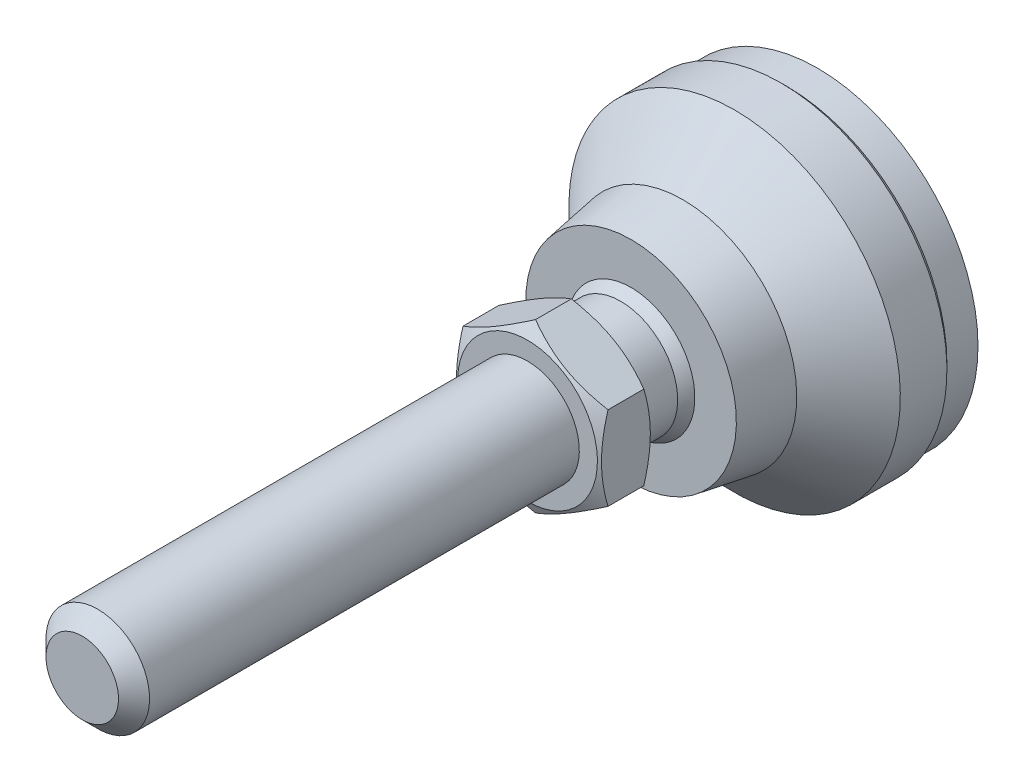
ISO-10303-21;
HEADER;
FILE_DESCRIPTION(('STEP AP214'),'2;1');
FILE_NAME('part.step','',(''),(''),'','','');
FILE_SCHEMA(('AUTOMOTIVE_DESIGN { 1 0 10303 214 1 1 1 1 }'));
ENDSEC;
DATA;
#1=APPLICATION_CONTEXT('core data for automotive mechanical design processes');
#2=APPLICATION_PROTOCOL_DEFINITION('international standard','automotive_design',2000,#1);
#3=PRODUCT_CONTEXT('',#1,'mechanical');
#4=PRODUCT('Part','Part','',(#3));
#5=PRODUCT_RELATED_PRODUCT_CATEGORY('part','',(#4));
#6=PRODUCT_DEFINITION_FORMATION('','',#4);
#7=PRODUCT_DEFINITION_CONTEXT('part definition',#1,'design');
#8=PRODUCT_DEFINITION('design','',#6,#7);
#9=PRODUCT_DEFINITION_SHAPE('','',#8);
#10=(LENGTH_UNIT() NAMED_UNIT(*) SI_UNIT(.MILLI.,.METRE.));
#11=(NAMED_UNIT(*) PLANE_ANGLE_UNIT() SI_UNIT($,.RADIAN.));
#12=(NAMED_UNIT(*) SI_UNIT($,.STERADIAN.) SOLID_ANGLE_UNIT());
#13=UNCERTAINTY_MEASURE_WITH_UNIT(LENGTH_MEASURE(1.E-05),#10,'distance_accuracy_value','');
#14=(GEOMETRIC_REPRESENTATION_CONTEXT(3) GLOBAL_UNCERTAINTY_ASSIGNED_CONTEXT((#13)) GLOBAL_UNIT_ASSIGNED_CONTEXT((#10,
#11,#12)) REPRESENTATION_CONTEXT('',''));
#15=CARTESIAN_POINT('',(0.,0.,0.));
#16=DIRECTION('',(0.,0.,1.));
#17=DIRECTION('',(1.,0.,0.));
#18=AXIS2_PLACEMENT_3D('',#15,#16,#17);
#19=CARTESIAN_POINT('',(0.,0.,3.));
#20=DIRECTION('',(0.,0.,-1.));
#21=DIRECTION('',(0.,1.,0.));
#22=AXIS2_PLACEMENT_3D('',#19,#20,#21);
#23=CYLINDRICAL_SURFACE('',#22,5.49999999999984);
#24=CARTESIAN_POINT('',(0.,0.,23.));
#25=DIRECTION('',(0.,0.,-1.));
#26=DIRECTION('',(0.,1.,0.));
#27=AXIS2_PLACEMENT_3D('',#24,#25,#26);
#28=CIRCLE('',#27,5.49999999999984);
#29=CARTESIAN_POINT('',(0.,5.49999999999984,23.));
#30=VERTEX_POINT('',#29);
#31=EDGE_CURVE('E112',#30,#30,#28,.T.);
#32=ORIENTED_EDGE('',*,*,#31,.T.);
#33=EDGE_LOOP('',(#32));
#34=FACE_BOUND('',#33,.T.);
#35=CARTESIAN_POINT('',(0.,0.,19.0000000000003));
#36=DIRECTION('',(0.,0.,1.));
#37=DIRECTION('',(0.,-1.,0.));
#38=AXIS2_PLACEMENT_3D('',#35,#36,#37);
#39=CIRCLE('',#38,5.49999999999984);
#40=CARTESIAN_POINT('',(-5.49999999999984,0.,19.0000000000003));
#41=VERTEX_POINT('',#40);
#42=EDGE_CURVE('E115',#41,#41,#39,.T.);
#43=ORIENTED_EDGE('',*,*,#42,.T.);
#44=EDGE_LOOP('',(#43));
#45=FACE_BOUND('',#44,.T.);
#46=ADVANCED_FACE('F14',(#34,#45),#23,.T.);
#47=CARTESIAN_POINT('',(0.,0.,14.6698729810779));
#48=DIRECTION('',(0.,0.,1.));
#49=DIRECTION('',(-1.,0.,0.));
#50=AXIS2_PLACEMENT_3D('',#47,#48,#49);
#51=SPHERICAL_SURFACE('',#50,7.);
#52=CARTESIAN_POINT('',(0.,0.,18.));
#53=DIRECTION('',(0.,0.,1.));
#54=DIRECTION('',(0.,-1.,0.));
#55=AXIS2_PLACEMENT_3D('',#52,#53,#54);
#56=CIRCLE('',#55,6.15713034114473);
#57=CARTESIAN_POINT('',(-6.15713034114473,0.,18.));
#58=VERTEX_POINT('',#57);
#59=EDGE_CURVE('E284',#58,#58,#56,.T.);
#60=CARTESIAN_POINT('',(-5.49999999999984,0.,19.0000000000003));
#61=CARTESIAN_POINT('',(-5.50771979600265,0.,18.9901945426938));
#62=CARTESIAN_POINT('',(-5.51541336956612,0.,18.9803684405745));
#63=CARTESIAN_POINT('',(-5.53074785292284,0.,18.9606752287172));
#64=CARTESIAN_POINT('',(-5.53838876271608,0.,18.9508081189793));
#65=CARTESIAN_POINT('',(-5.55361769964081,0.,18.9310331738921));
#66=CARTESIAN_POINT('',(-5.56120572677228,0.,18.9211253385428));
#67=CARTESIAN_POINT('',(-5.57632868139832,0.,18.9012692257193));
#68=CARTESIAN_POINT('',(-5.58386360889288,0.,18.8913209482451));
#69=CARTESIAN_POINT('',(-5.59888014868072,0.,18.871384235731));
#70=CARTESIAN_POINT('',(-5.60636176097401,0.,18.8613958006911));
#71=CARTESIAN_POINT('',(-5.62127145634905,0.,18.841379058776));
#72=CARTESIAN_POINT('',(-5.62869953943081,0.,18.8313507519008));
#73=CARTESIAN_POINT('',(-5.64350196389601,0.,18.81125455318));
#74=CARTESIAN_POINT('',(-5.65087630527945,0.,18.8011866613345));
#75=CARTESIAN_POINT('',(-5.66557103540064,0.,18.781011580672));
#76=CARTESIAN_POINT('',(-5.67289142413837,0.,18.770904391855));
#77=CARTESIAN_POINT('',(-5.68747803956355,0.,18.7506510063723));
#78=CARTESIAN_POINT('',(-5.69474426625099,0.,18.7405048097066));
#79=CARTESIAN_POINT('',(-5.70922234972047,0.,18.7201736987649));
#80=CARTESIAN_POINT('',(-5.7164342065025,0.,18.7099887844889));
#81=CARTESIAN_POINT('',(-5.7308033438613,0.,18.6895805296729));
#82=CARTESIAN_POINT('',(-5.73796062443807,0.,18.6793571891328));
#83=CARTESIAN_POINT('',(-5.75222040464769,0.,18.6588723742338));
#84=CARTESIAN_POINT('',(-5.75932290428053,0.,18.6486108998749));
#85=CARTESIAN_POINT('',(-5.77347291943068,0.,18.6280501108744));
#86=CARTESIAN_POINT('',(-5.78052043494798,0.,18.6177507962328));
#87=CARTESIAN_POINT('',(-5.79456028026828,0.,18.5971146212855));
#88=CARTESIAN_POINT('',(-5.80155261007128,0.,18.5867777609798));
#89=CARTESIAN_POINT('',(-5.81548188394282,0.,18.5660667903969));
#90=CARTESIAN_POINT('',(-5.82241882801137,0.,18.5556926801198));
#91=CARTESIAN_POINT('',(-5.83623713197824,0.,18.5349075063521));
#92=CARTESIAN_POINT('',(-5.84311849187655,0.,18.5244964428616));
#93=CARTESIAN_POINT('',(-5.85682543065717,0.,18.5036376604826));
#94=CARTESIAN_POINT('',(-5.86365100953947,0.,18.493189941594));
#95=CARTESIAN_POINT('',(-5.87724619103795,0.,18.4722581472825));
#96=CARTESIAN_POINT('',(-5.88401579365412,0.,18.4617740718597));
#97=CARTESIAN_POINT('',(-5.89749882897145,0.,18.4407698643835));
#98=CARTESIAN_POINT('',(-5.90421226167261,0.,18.4302497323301));
#99=CARTESIAN_POINT('',(-5.91758276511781,0.,18.4091737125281));
#100=CARTESIAN_POINT('',(-5.92423983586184,0.,18.3986178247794));
#101=CARTESIAN_POINT('',(-5.93749742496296,0.,18.3774705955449));
#102=CARTESIAN_POINT('',(-5.94409794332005,0.,18.366879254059));
#103=CARTESIAN_POINT('',(-5.95724223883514,0.,18.3456614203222));
#104=CARTESIAN_POINT('',(-5.96378601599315,0.,18.3350349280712));
#105=CARTESIAN_POINT('',(-5.9768166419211,0.,18.313747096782));
#106=CARTESIAN_POINT('',(-5.98330349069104,0.,18.3030857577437));
#107=CARTESIAN_POINT('',(-5.99622007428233,0.,18.2817285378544));
#108=CARTESIAN_POINT('',(-6.00264980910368,0.,18.2710326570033));
#109=CARTESIAN_POINT('',(-6.015451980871,0.,18.249606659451));
#110=CARTESIAN_POINT('',(-6.02182441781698,0.,18.2388765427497));
#111=CARTESIAN_POINT('',(-6.034511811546,0.,18.217382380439));
#112=CARTESIAN_POINT('',(-6.04082676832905,0.,18.2066183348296));
#113=CARTESIAN_POINT('',(-6.05339902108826,0.,18.1850566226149));
#114=CARTESIAN_POINT('',(-6.05965631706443,0.,18.1742589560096));
#115=CARTESIAN_POINT('',(-6.07211306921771,0.,18.1526303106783));
#116=CARTESIAN_POINT('',(-6.07831252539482,0.,18.1417993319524));
#117=CARTESIAN_POINT('',(-6.09065342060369,0.,18.1201043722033));
#118=CARTESIAN_POINT('',(-6.09679485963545,0.,18.1092403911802));
#119=CARTESIAN_POINT('',(-6.10901954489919,0.,18.0874797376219));
#120=CARTESIAN_POINT('',(-6.11510279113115,0.,18.0765830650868));
#121=CARTESIAN_POINT('',(-6.12721091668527,0.,18.054757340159));
#122=CARTESIAN_POINT('',(-6.13323579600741,0.,18.0438282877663));
#123=CARTESIAN_POINT('',(-6.14522701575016,0.,18.0219381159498));
#124=CARTESIAN_POINT('',(-6.15119335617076,0.,18.010976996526));
#125=CARTESIAN_POINT('',(-6.15713034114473,0.,18.));
#126=B_SPLINE_CURVE_WITH_KNOTS('',3,(#60,#61,#62,#63,#64,#65,#66,#67,#68,#69,#70,#71,#72,#73,
#74,#75,#76,#77,#78,#79,#80,#81,#82,#83,#84,#85,#86,#87,#88,#89,#90,#91,#92,#93,#94,#95,#96,#97,
#98,#99,#100,#101,#102,#103,#104,#105,#106,#107,#108,#109,#110,#111,#112,#113,#114,#115,#116,
#117,#118,#119,#120,#121,#122,#123,#124,#125),.UNSPECIFIED.,.F.,.F.,(4,2,2,2,2,2,2,2,2,2,2,2,2,
2,2,2,2,2,2,2,2,2,2,2,2,2,2,2,2,2,2,2,4),(0.,0.0374389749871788,0.0748779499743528,
0.112316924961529,0.149755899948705,0.187194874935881,0.224633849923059,0.262072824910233,
0.29951179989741,0.336950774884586,0.374389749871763,0.411828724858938,0.449267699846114,
0.486706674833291,0.524145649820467,0.561584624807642,0.599023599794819,0.636462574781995,
0.673901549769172,0.711340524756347,0.748779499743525,0.786218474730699,0.823657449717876,
0.86109642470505,0.898535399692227,0.935974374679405,0.973413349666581,1.01085232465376,
1.04829129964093,1.08573027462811,1.12316924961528,1.16060822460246,1.19804719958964),.UNSPECIFIED.);
#127=EDGE_CURVE('BSEAM243',#41,#58,#126,.T.);
#128=ORIENTED_EDGE('',*,*,#42,.F.);
#129=ORIENTED_EDGE('',*,*,#59,.T.);
#130=ORIENTED_EDGE('',*,*,#127,.T.);
#131=ORIENTED_EDGE('',*,*,#127,.F.);
#132=EDGE_LOOP('',(#128,#130,#129,#131));
#133=FACE_BOUND('',#132,.T.);
#134=ADVANCED_FACE('F243',(#133),#51,.T.);
#135=CARTESIAN_POINT('',(0.,0.,3.50000000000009));
#136=DIRECTION('',(0.,0.,1.));
#137=DIRECTION('',(0.,-1.,0.));
#138=AXIS2_PLACEMENT_3D('',#135,#136,#137);
#139=CONICAL_SURFACE('',#138,16.,0.785398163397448);
#140=CARTESIAN_POINT('',(0.,0.,3.00000000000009));
#141=DIRECTION('',(0.,0.,-1.));
#142=DIRECTION('',(0.,1.,0.));
#143=AXIS2_PLACEMENT_3D('',#140,#141,#142);
#144=CIRCLE('',#143,15.5);
#145=CARTESIAN_POINT('',(0.,15.5,3.00000000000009));
#146=VERTEX_POINT('',#145);
#147=EDGE_CURVE('E85',#146,#146,#144,.T.);
#148=ORIENTED_EDGE('',*,*,#147,.F.);
#149=EDGE_LOOP('',(#148));
#150=FACE_BOUND('',#149,.T.);
#151=CARTESIAN_POINT('',(0.,0.,3.50000000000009));
#152=DIRECTION('',(0.,0.,-1.));
#153=DIRECTION('',(0.,1.,0.));
#154=AXIS2_PLACEMENT_3D('',#151,#152,#153);
#155=CIRCLE('',#154,16.);
#156=CARTESIAN_POINT('',(0.,16.,3.50000000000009));
#157=VERTEX_POINT('',#156);
#158=EDGE_CURVE('E88',#157,#157,#155,.T.);
#159=ORIENTED_EDGE('',*,*,#158,.T.);
#160=EDGE_LOOP('',(#159));
#161=FACE_BOUND('',#160,.T.);
#162=ADVANCED_FACE('F246',(#150,#161),#139,.T.);
#163=CARTESIAN_POINT('',(0.,0.,3.));
#164=DIRECTION('',(0.,0.,-1.));
#165=DIRECTION('',(0.,1.,0.));
#166=AXIS2_PLACEMENT_3D('',#163,#164,#165);
#167=CYLINDRICAL_SURFACE('',#166,16.);
#168=ORIENTED_EDGE('',*,*,#158,.F.);
#169=EDGE_LOOP('',(#168));
#170=FACE_BOUND('',#169,.T.);
#171=CARTESIAN_POINT('',(0.,0.,8.00000000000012));
#172=DIRECTION('',(0.,0.,-1.));
#173=DIRECTION('',(0.,1.,0.));
#174=AXIS2_PLACEMENT_3D('',#171,#172,#173);
#175=CIRCLE('',#174,16.);
#176=CARTESIAN_POINT('',(0.,16.,8.00000000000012));
#177=VERTEX_POINT('',#176);
#178=EDGE_CURVE('E105',#177,#177,#175,.T.);
#179=ORIENTED_EDGE('',*,*,#178,.T.);
#180=EDGE_LOOP('',(#179));
#181=FACE_BOUND('',#180,.T.);
#182=ADVANCED_FACE('F391',(#170,#181),#167,.T.);
#183=CARTESIAN_POINT('',(0.,0.,13.));
#184=DIRECTION('',(0.,0.,-1.));
#185=DIRECTION('',(0.,1.,0.));
#186=AXIS2_PLACEMENT_3D('',#183,#184,#185);
#187=CONICAL_SURFACE('',#186,11.,0.785398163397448);
#188=ORIENTED_EDGE('',*,*,#178,.F.);
#189=EDGE_LOOP('',(#188));
#190=FACE_BOUND('',#189,.T.);
#191=CARTESIAN_POINT('',(0.,0.,13.));
#192=DIRECTION('',(0.,0.,-1.));
#193=DIRECTION('',(0.,1.,0.));
#194=AXIS2_PLACEMENT_3D('',#191,#192,#193);
#195=CIRCLE('',#194,11.);
#196=CARTESIAN_POINT('',(0.,11.,13.));
#197=VERTEX_POINT('',#196);
#198=EDGE_CURVE('E108',#197,#197,#195,.T.);
#199=ORIENTED_EDGE('',*,*,#198,.T.);
#200=EDGE_LOOP('',(#199));
#201=FACE_BOUND('',#200,.T.);
#202=ADVANCED_FACE('F398',(#190,#201),#187,.T.);
#203=CARTESIAN_POINT('',(0.,0.,19.));
#204=DIRECTION('',(0.,0.,-1.));
#205=DIRECTION('',(0.,1.,0.));
#206=AXIS2_PLACEMENT_3D('',#203,#204,#205);
#207=CONICAL_SURFACE('',#206,10.,0.165148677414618);
#208=ORIENTED_EDGE('',*,*,#198,.F.);
#209=EDGE_LOOP('',(#208));
#210=FACE_BOUND('',#209,.T.);
#211=CARTESIAN_POINT('',(0.,0.,18.));
#212=DIRECTION('',(0.,0.,-1.));
#213=DIRECTION('',(0.,1.,0.));
#214=AXIS2_PLACEMENT_3D('',#211,#212,#213);
#215=CIRCLE('',#214,10.1666666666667);
#216=CARTESIAN_POINT('',(0.,10.1666666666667,18.));
#217=VERTEX_POINT('',#216);
#218=EDGE_CURVE('E93',#217,#217,#215,.T.);
#219=ORIENTED_EDGE('',*,*,#218,.T.);
#220=EDGE_LOOP('',(#219));
#221=FACE_BOUND('',#220,.T.);
#222=ADVANCED_FACE('F241',(#210,#221),#207,.T.);
#223=CARTESIAN_POINT('',(-10.1666666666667,0.,18.));
#224=DIRECTION('',(0.,0.,1.));
#225=DIRECTION('',(0.,-1.,0.));
#226=AXIS2_PLACEMENT_3D('',#223,#224,#225);
#227=PLANE('',#226);
#228=ORIENTED_EDGE('',*,*,#218,.F.);
#229=EDGE_LOOP('',(#228));
#230=FACE_BOUND('',#229,.T.);
#231=ORIENTED_EDGE('',*,*,#59,.F.);
#232=EDGE_LOOP('',(#231));
#233=FACE_BOUND('',#232,.T.);
#234=ADVANCED_FACE('F236',(#230,#233),#227,.T.);
#235=CARTESIAN_POINT('',(0.,-8.08290376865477,23.));
#236=DIRECTION('',(0.,0.,-1.));
#237=DIRECTION('',(0.,1.,0.));
#238=AXIS2_PLACEMENT_3D('',#235,#236,#237);
#239=PLANE('',#238);
#240=CARTESIAN_POINT('',(0.,0.,23.));
#241=DIRECTION('',(0.,0.,1.));
#242=DIRECTION('',(0.,-1.,0.));
#243=AXIS2_PLACEMENT_3D('',#240,#241,#242);
#244=CIRCLE('',#243,6.75);
#245=CARTESIAN_POINT('',(0.,-6.75,23.));
#246=VERTEX_POINT('',#245);
#247=EDGE_CURVE('E80',#246,#246,#244,.T.);
#248=ORIENTED_EDGE('',*,*,#247,.F.);
#249=EDGE_LOOP('',(#248));
#250=FACE_BOUND('',#249,.T.);
#251=ORIENTED_EDGE('',*,*,#31,.F.);
#252=EDGE_LOOP('',(#251));
#253=FACE_BOUND('',#252,.T.);
#254=ADVANCED_FACE('F240',(#250,#253),#239,.T.);
#255=CARTESIAN_POINT('',(0.,0.,0.));
#256=DIRECTION('',(0.,0.,1.));
#257=DIRECTION('',(0.,-1.,0.));
#258=AXIS2_PLACEMENT_3D('',#255,#256,#257);
#259=CYLINDRICAL_SURFACE('',#258,15.5);
#260=CARTESIAN_POINT('',(0.,0.,0.));
#261=DIRECTION('',(0.,0.,-1.));
#262=DIRECTION('',(0.,1.,0.));
#263=AXIS2_PLACEMENT_3D('',#260,#261,#262);
#264=CIRCLE('',#263,15.5);
#265=CARTESIAN_POINT('',(0.,15.5,0.));
#266=VERTEX_POINT('',#265);
#267=EDGE_CURVE('E292',#266,#266,#264,.T.);
#268=ORIENTED_EDGE('',*,*,#267,.F.);
#269=EDGE_LOOP('',(#268));
#270=FACE_BOUND('',#269,.T.);
#271=ORIENTED_EDGE('',*,*,#147,.T.);
#272=EDGE_LOOP('',(#271));
#273=FACE_BOUND('',#272,.T.);
#274=ADVANCED_FACE('F250',(#270,#273),#259,.T.);
#275=CARTESIAN_POINT('',(0.,0.,0.));
#276=DIRECTION('',(0.,0.,-1.));
#277=DIRECTION('',(0.,1.,0.));
#278=AXIS2_PLACEMENT_3D('',#275,#276,#277);
#279=PLANE('',#278);
#280=ORIENTED_EDGE('',*,*,#267,.T.);
#281=EDGE_LOOP('',(#280));
#282=FACE_BOUND('',#281,.T.);
#283=ADVANCED_FACE('F133',(#282),#279,.T.);
#284=CARTESIAN_POINT('',(0.,0.,23.));
#285=DIRECTION('',(0.,0.,1.));
#286=DIRECTION('',(0.,-1.,0.));
#287=AXIS2_PLACEMENT_3D('',#284,#285,#286);
#288=CONICAL_SURFACE('',#287,6.75,1.0471975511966);
#289=CARTESIAN_POINT('',(7.0002,-4.04133641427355,23.7696190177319));
#290=CARTESIAN_POINT('',(6.84633209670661,-4.13017208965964,23.7183374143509));
#291=CARTESIAN_POINT('',(6.69189049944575,-4.21933898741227,23.669383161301));
#292=CARTESIAN_POINT('',(6.38175307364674,-4.3983969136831,23.5767703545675));
#293=CARTESIAN_POINT('',(6.22605673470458,-4.4882882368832,23.5331140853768));
#294=CARTESIAN_POINT('',(5.75647483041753,-4.7594014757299,23.4109491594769));
#295=CARTESIAN_POINT('',(5.4407356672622,-4.94169356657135,23.3414631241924));
#296=CARTESIAN_POINT('',(4.96823775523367,-5.21449036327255,23.2599825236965));
#297=CARTESIAN_POINT('',(4.81289077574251,-5.30417998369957,23.2367710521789));
#298=CARTESIAN_POINT('',(4.50149488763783,-5.48396448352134,23.1978487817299));
#299=CARTESIAN_POINT('',(4.34544604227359,-5.57405932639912,23.1821373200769));
#300=CARTESIAN_POINT('',(4.03307732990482,-5.75440548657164,23.1586154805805));
#301=CARTESIAN_POINT('',(3.87675797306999,-5.84465650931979,23.1507961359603));
#302=CARTESIAN_POINT('',(3.56398349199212,-6.02523694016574,23.1432178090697));
#303=CARTESIAN_POINT('',(3.40752837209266,-6.11556634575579,23.1434585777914));
#304=CARTESIAN_POINT('',(2.97889312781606,-6.36303901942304,23.155197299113));
#305=CARTESIAN_POINT('',(2.7068533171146,-6.52010127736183,23.1749033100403));
#306=CARTESIAN_POINT('',(2.1645805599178,-6.8331825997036,23.2373910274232));
#307=CARTESIAN_POINT('',(1.89434952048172,-6.98920056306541,23.2801940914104));
#308=CARTESIAN_POINT('',(1.35098545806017,-7.30291195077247,23.3871892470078));
#309=CARTESIAN_POINT('',(1.07792099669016,-7.46056579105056,23.4518346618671));
#310=CARTESIAN_POINT('',(0.535864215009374,-7.77352241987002,23.5985536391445));
#311=CARTESIAN_POINT('',(0.266864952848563,-7.92882921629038,23.680592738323));
#312=CARTESIAN_POINT('',(-0.000199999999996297,-8.08301923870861,23.7696190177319));
#313=B_SPLINE_CURVE_WITH_KNOTS('',3,(#289,#290,#291,#292,#293,#294,#295,#296,#297,#298,#299,
#300,#301,#302,#303,#304,#305,#306,#307,#308,#309,#310,#311,#312),.UNSPECIFIED.,.F.,.F.,(4,2,2,
2,2,2,2,2,2,2,2,4),(0.,0.554727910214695,1.10969417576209,2.2219327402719,2.76443041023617,
3.30688013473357,3.8487128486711,4.39052882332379,5.33376515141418,6.27787517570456,
7.24292418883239,8.20607866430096),.UNSPECIFIED.);
#314=CARTESIAN_POINT('',(7.,-4.04145188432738,23.7695523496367));
#315=VERTEX_POINT('',#314);
#316=CARTESIAN_POINT('',(0.,-8.08290376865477,23.7695523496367));
#317=VERTEX_POINT('',#316);
#318=EDGE_CURVE('E33',#315,#317,#313,.T.);
#319=ORIENTED_EDGE('',*,*,#318,.T.);
#320=CARTESIAN_POINT('',(0.000200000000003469,-8.0830192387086,23.7696190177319));
#321=CARTESIAN_POINT('',(-0.15366790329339,-7.99418356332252,23.7183374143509));
#322=CARTESIAN_POINT('',(-0.308109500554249,-7.90501666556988,23.669383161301));
#323=CARTESIAN_POINT('',(-0.618246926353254,-7.72595873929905,23.5767703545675));
#324=CARTESIAN_POINT('',(-0.773943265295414,-7.63606741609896,23.5331140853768));
#325=CARTESIAN_POINT('',(-1.24352516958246,-7.36495417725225,23.4109491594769));
#326=CARTESIAN_POINT('',(-1.5592643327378,-7.18266208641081,23.3414631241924));
#327=CARTESIAN_POINT('',(-2.03176224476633,-6.90986528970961,23.2599825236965));
#328=CARTESIAN_POINT('',(-2.18710922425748,-6.82017566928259,23.2367710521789));
#329=CARTESIAN_POINT('',(-2.49850511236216,-6.64039116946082,23.1978487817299));
#330=CARTESIAN_POINT('',(-2.65455395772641,-6.55029632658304,23.1821373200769));
#331=CARTESIAN_POINT('',(-2.96692267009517,-6.36995016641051,23.1586154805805));
#332=CARTESIAN_POINT('',(-3.12324202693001,-6.27969914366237,23.1507961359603));
#333=CARTESIAN_POINT('',(-3.43601650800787,-6.09911871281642,23.1432178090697));
#334=CARTESIAN_POINT('',(-3.59247162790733,-6.00878930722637,23.1434585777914));
#335=CARTESIAN_POINT('',(-4.02110687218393,-5.76131663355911,23.155197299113));
#336=CARTESIAN_POINT('',(-4.29314668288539,-5.60425437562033,23.1749033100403));
#337=CARTESIAN_POINT('',(-4.83541944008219,-5.29117305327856,23.2373910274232));
#338=CARTESIAN_POINT('',(-5.10565047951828,-5.13515508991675,23.2801940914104));
#339=CARTESIAN_POINT('',(-5.64901454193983,-4.82144370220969,23.3871892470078));
#340=CARTESIAN_POINT('',(-5.92207900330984,-4.6637898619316,23.4518346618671));
#341=CARTESIAN_POINT('',(-6.46413578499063,-4.35083323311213,23.5985536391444));
#342=CARTESIAN_POINT('',(-6.73313504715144,-4.19552643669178,23.680592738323));
#343=CARTESIAN_POINT('',(-7.0002,-4.04133641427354,23.7696190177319));
#344=B_SPLINE_CURVE_WITH_KNOTS('',3,(#320,#321,#322,#323,#324,#325,#326,#327,#328,#329,#330,
#331,#332,#333,#334,#335,#336,#337,#338,#339,#340,#341,#342,#343),.UNSPECIFIED.,.F.,.F.,(4,2,2,
2,2,2,2,2,2,2,2,4),(0.,0.554727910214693,1.10969417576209,2.2219327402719,2.76443041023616,
3.30688013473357,3.84871284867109,4.39052882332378,5.33376515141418,6.27787517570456,
7.2429241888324,8.20607866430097),.UNSPECIFIED.);
#345=CARTESIAN_POINT('',(-7.,-4.04145188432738,23.7695523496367));
#346=VERTEX_POINT('',#345);
#347=EDGE_CURVE('E9',#317,#346,#344,.T.);
#348=ORIENTED_EDGE('',*,*,#347,.T.);
#349=CARTESIAN_POINT('',(-7.,10.8531187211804,26.5592070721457));
#350=CARTESIAN_POINT('',(-7.,10.5474047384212,26.4109193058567));
#351=CARTESIAN_POINT('',(-7.,10.2409886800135,26.2640541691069));
#352=CARTESIAN_POINT('',(-7.,9.62637902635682,25.9739693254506));
#353=CARTESIAN_POINT('',(-7.,9.31818515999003,25.8307501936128));
#354=CARTESIAN_POINT('',(-7.,8.69805731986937,25.5480364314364));
#355=CARTESIAN_POINT('',(-7.,8.3861121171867,25.4085663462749));
#356=CARTESIAN_POINT('',(-7.,7.75973970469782,25.1353373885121));
#357=CARTESIAN_POINT('',(-7.,7.44531261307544,25.0015782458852));
#358=CARTESIAN_POINT('',(-7.,6.80333875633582,24.7371027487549));
#359=CARTESIAN_POINT('',(-7.,6.47569459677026,24.6066214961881));
#360=CARTESIAN_POINT('',(-7.,5.81657285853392,24.3555408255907));
#361=CARTESIAN_POINT('',(-7.,5.48509485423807,24.2349425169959));
#362=CARTESIAN_POINT('',(-7.,4.81839534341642,24.0067959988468));
#363=CARTESIAN_POINT('',(-7.,4.48318298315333,23.8992213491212));
#364=CARTESIAN_POINT('',(-7.,3.80796186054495,23.7005744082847));
#365=CARTESIAN_POINT('',(-7.,3.4679546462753,23.6094969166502));
#366=CARTESIAN_POINT('',(-7.,2.78478034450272,23.4487070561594));
#367=CARTESIAN_POINT('',(-7.,2.441641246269,23.3788789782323));
#368=CARTESIAN_POINT('',(-7.,1.92381001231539,23.2930984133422));
#369=CARTESIAN_POINT('',(-7.,1.75066644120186,23.267663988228));
#370=CARTESIAN_POINT('',(-7.,1.40351960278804,23.2236145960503));
#371=CARTESIAN_POINT('',(-7.,1.22951642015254,23.2049989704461));
#372=CARTESIAN_POINT('',(-7.,0.88315555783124,23.1751913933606));
#373=CARTESIAN_POINT('',(-7.,0.710805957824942,23.1639059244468));
#374=CARTESIAN_POINT('',(-7.,0.365784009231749,23.1486331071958));
#375=CARTESIAN_POINT('',(-7.,0.193111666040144,23.1446456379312));
#376=CARTESIAN_POINT('',(-7.,-0.152247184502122,23.1440639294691));
#377=CARTESIAN_POINT('',(-7.,-0.324933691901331,23.1474697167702));
#378=CARTESIAN_POINT('',(-7.,-0.670009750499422,23.1615913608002));
#379=CARTESIAN_POINT('',(-7.,-0.842399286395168,23.1723075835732));
#380=CARTESIAN_POINT('',(-7.,-1.25678281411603,23.2066267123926));
#381=CARTESIAN_POINT('',(-7.,-1.49849523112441,23.2337025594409));
#382=CARTESIAN_POINT('',(-7.,-1.98011296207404,23.3007484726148));
#383=CARTESIAN_POINT('',(-7.,-2.22001802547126,23.3407202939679));
#384=CARTESIAN_POINT('',(-7.,-2.93675513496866,23.4778590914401));
#385=CARTESIAN_POINT('',(-7.,-3.41033934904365,23.5922241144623));
#386=CARTESIAN_POINT('',(-7.,-4.11847376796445,23.7903830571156));
#387=CARTESIAN_POINT('',(-7.,-4.356700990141,23.8617912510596));
#388=CARTESIAN_POINT('',(-7.,-4.83084131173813,24.0119846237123));
#389=CARTESIAN_POINT('',(-7.,-5.06675439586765,24.0907698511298));
#390=CARTESIAN_POINT('',(-7.,-5.53634144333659,24.2544564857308));
#391=CARTESIAN_POINT('',(-7.,-5.77001612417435,24.3393558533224));
#392=CARTESIAN_POINT('',(-7.,-6.23543203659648,24.5142757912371));
#393=CARTESIAN_POINT('',(-7.,-6.46717329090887,24.6042963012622));
#394=CARTESIAN_POINT('',(-7.,-7.01442504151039,24.8227292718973));
#395=CARTESIAN_POINT('',(-7.,-7.32918572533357,24.9530168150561));
#396=CARTESIAN_POINT('',(-7.,-7.95602894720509,25.2199010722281));
#397=CARTESIAN_POINT('',(-7.,-8.26811131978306,25.3564981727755));
#398=CARTESIAN_POINT('',(-7.,-8.89009136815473,25.6347326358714));
#399=CARTESIAN_POINT('',(-7.,-9.19998858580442,25.7763710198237));
#400=CARTESIAN_POINT('',(-7.,-9.81791263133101,26.0636778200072));
#401=CARTESIAN_POINT('',(-7.,-10.1259394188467,26.2093463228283));
#402=CARTESIAN_POINT('',(-7.,-10.7407530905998,26.5041110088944));
#403=CARTESIAN_POINT('',(-7.,-11.047538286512,26.6532107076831));
#404=CARTESIAN_POINT('',(-7.,-11.659786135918,26.9541036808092));
#405=CARTESIAN_POINT('',(-7.,-11.9652487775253,27.1058969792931));
#406=CARTESIAN_POINT('',(-7.,-12.879887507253,27.5645591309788));
#407=CARTESIAN_POINT('',(-7.,-13.4873973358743,27.8747503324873));
#408=CARTESIAN_POINT('',(-7.,-14.6482473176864,28.4750183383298));
#409=CARTESIAN_POINT('',(-7.,-15.2018478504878,28.7645938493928));
#410=CARTESIAN_POINT('',(-7.,-16.3069938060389,29.3476848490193));
#411=CARTESIAN_POINT('',(-7.,-16.8585391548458,29.6412004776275));
#412=CARTESIAN_POINT('',(-7.,-17.9586488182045,30.2304932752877));
#413=CARTESIAN_POINT('',(-7.,-18.5072171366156,30.5262629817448));
#414=CARTESIAN_POINT('',(-7.,-19.6030401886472,31.120154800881));
#415=CARTESIAN_POINT('',(-7.,-20.1502949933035,31.41827678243));
#416=CARTESIAN_POINT('',(-7.,-20.6970665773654,31.7172764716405));
#417=B_SPLINE_CURVE_WITH_KNOTS('',3,(#349,#350,#351,#352,#353,#354,#355,#356,#357,#358,#359,
#360,#361,#362,#363,#364,#365,#366,#367,#368,#369,#370,#371,#372,#373,#374,#375,#376,#377,#378,
#379,#380,#381,#382,#383,#384,#385,#386,#387,#388,#389,#390,#391,#392,#393,#394,#395,#396,#397,
#398,#399,#400,#401,#402,#403,#404,#405,#406,#407,#408,#409,#410,#411,#412,#413,#414,#415,#416),
.UNSPECIFIED.,.F.,.F.,(4,2,2,2,2,2,2,2,2,2,2,2,2,2,2,2,2,2,2,2,2,2,2,2,2,2,2,2,2,2,2,2,2,4),(0.,
1.01935180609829,2.0388634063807,3.063929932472,4.08894793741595,5.14683390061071,
6.20483845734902,7.26065773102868,8.31614358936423,9.36577471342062,9.89066676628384,
10.4155081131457,10.9335147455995,11.4515127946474,11.9695127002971,12.4875385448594,
13.2167988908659,13.9461585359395,15.4056869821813,16.1517230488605,16.8977640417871,
17.6435573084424,18.389341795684,19.4112284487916,20.4331777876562,21.4553353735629,
22.4775149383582,23.5007930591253,24.524080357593,26.5703786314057,28.444647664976,
30.3189834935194,32.1886464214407,34.0582058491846),.UNSPECIFIED.);
#418=CARTESIAN_POINT('',(-7.,4.04145188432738,23.7695523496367));
#419=VERTEX_POINT('',#418);
#420=EDGE_CURVE('E72',#346,#419,#417,.F.);
#421=ORIENTED_EDGE('',*,*,#420,.T.);
#422=CARTESIAN_POINT('',(-7.0002,4.04133641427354,23.7696190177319));
#423=CARTESIAN_POINT('',(-6.84633209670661,4.13017208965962,23.7183374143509));
#424=CARTESIAN_POINT('',(-6.69189049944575,4.21933898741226,23.669383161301));
#425=CARTESIAN_POINT('',(-6.38175307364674,4.39839691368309,23.5767703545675));
#426=CARTESIAN_POINT('',(-6.22605673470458,4.48828823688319,23.5331140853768));
#427=CARTESIAN_POINT('',(-5.75647483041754,4.75940147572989,23.4109491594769));
#428=CARTESIAN_POINT('',(-5.4407356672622,4.94169356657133,23.3414631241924));
#429=CARTESIAN_POINT('',(-4.96823775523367,5.21449036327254,23.2599825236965));
#430=CARTESIAN_POINT('',(-4.81289077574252,5.30417998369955,23.2367710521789));
#431=CARTESIAN_POINT('',(-4.50149488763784,5.48396448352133,23.1978487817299));
#432=CARTESIAN_POINT('',(-4.34544604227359,5.57405932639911,23.1821373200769));
#433=CARTESIAN_POINT('',(-4.03307732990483,5.75440548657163,23.1586154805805));
#434=CARTESIAN_POINT('',(-3.87675797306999,5.84465650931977,23.1507961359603));
#435=CARTESIAN_POINT('',(-3.56398349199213,6.02523694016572,23.1432178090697));
#436=CARTESIAN_POINT('',(-3.40752837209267,6.11556634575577,23.1434585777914));
#437=CARTESIAN_POINT('',(-2.97889312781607,6.36303901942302,23.155197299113));
#438=CARTESIAN_POINT('',(-2.7068533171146,6.52010127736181,23.1749033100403));
#439=CARTESIAN_POINT('',(-2.16458055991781,6.83318259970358,23.2373910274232));
#440=CARTESIAN_POINT('',(-1.89434952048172,6.9892005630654,23.2801940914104));
#441=CARTESIAN_POINT('',(-1.35098545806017,7.30291195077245,23.3871892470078));
#442=CARTESIAN_POINT('',(-1.07792099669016,7.46056579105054,23.4518346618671));
#443=CARTESIAN_POINT('',(-0.535864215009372,7.77352241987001,23.5985536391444));
#444=CARTESIAN_POINT('',(-0.266864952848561,7.92882921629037,23.680592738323));
#445=CARTESIAN_POINT('',(0.000199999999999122,8.0830192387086,23.7696190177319));
#446=B_SPLINE_CURVE_WITH_KNOTS('',3,(#422,#423,#424,#425,#426,#427,#428,#429,#430,#431,#432,
#433,#434,#435,#436,#437,#438,#439,#440,#441,#442,#443,#444,#445),.UNSPECIFIED.,.F.,.F.,(4,2,2,
2,2,2,2,2,2,2,2,4),(0.,0.554727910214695,1.10969417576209,2.2219327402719,2.76443041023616,
3.30688013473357,3.84871284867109,4.39052882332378,5.33376515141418,6.27787517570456,
7.2429241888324,8.20607866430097),.UNSPECIFIED.);
#447=CARTESIAN_POINT('',(0.,8.08290376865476,23.7695523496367));
#448=VERTEX_POINT('',#447);
#449=EDGE_CURVE('E79',#419,#448,#446,.T.);
#450=ORIENTED_EDGE('',*,*,#449,.T.);
#451=CARTESIAN_POINT('',(-0.000200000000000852,8.0830192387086,23.7696190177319));
#452=CARTESIAN_POINT('',(0.153667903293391,7.99418356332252,23.7183374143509));
#453=CARTESIAN_POINT('',(0.30810950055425,7.90501666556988,23.669383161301));
#454=CARTESIAN_POINT('',(0.618246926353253,7.72595873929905,23.5767703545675));
#455=CARTESIAN_POINT('',(0.773943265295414,7.63606741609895,23.5331140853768));
#456=CARTESIAN_POINT('',(1.24352516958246,7.36495417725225,23.4109491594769));
#457=CARTESIAN_POINT('',(1.5592643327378,7.18266208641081,23.3414631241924));
#458=CARTESIAN_POINT('',(2.03176224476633,6.9098652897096,23.2599825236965));
#459=CARTESIAN_POINT('',(2.18710922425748,6.82017566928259,23.2367710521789));
#460=CARTESIAN_POINT('',(2.49850511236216,6.64039116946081,23.1978487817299));
#461=CARTESIAN_POINT('',(2.6545539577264,6.55029632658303,23.1821373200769));
#462=CARTESIAN_POINT('',(2.96692267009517,6.36995016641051,23.1586154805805));
#463=CARTESIAN_POINT('',(3.12324202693,6.27969914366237,23.1507961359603));
#464=CARTESIAN_POINT('',(3.43601650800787,6.09911871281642,23.1432178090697));
#465=CARTESIAN_POINT('',(3.59247162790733,6.00878930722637,23.1434585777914));
#466=CARTESIAN_POINT('',(4.02110687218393,5.76131663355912,23.155197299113));
#467=CARTESIAN_POINT('',(4.29314668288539,5.60425437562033,23.1749033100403));
#468=CARTESIAN_POINT('',(4.83541944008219,5.29117305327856,23.2373910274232));
#469=CARTESIAN_POINT('',(5.10565047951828,5.13515508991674,23.2801940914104));
#470=CARTESIAN_POINT('',(5.64901454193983,4.82144370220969,23.3871892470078));
#471=CARTESIAN_POINT('',(5.92207900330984,4.66378986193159,23.4518346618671));
#472=CARTESIAN_POINT('',(6.46413578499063,4.35083323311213,23.5985536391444));
#473=CARTESIAN_POINT('',(6.73313504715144,4.19552643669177,23.680592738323));
#474=CARTESIAN_POINT('',(7.0002,4.04133641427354,23.7696190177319));
#475=B_SPLINE_CURVE_WITH_KNOTS('',3,(#451,#452,#453,#454,#455,#456,#457,#458,#459,#460,#461,
#462,#463,#464,#465,#466,#467,#468,#469,#470,#471,#472,#473,#474),.UNSPECIFIED.,.F.,.F.,(4,2,2,
2,2,2,2,2,2,2,2,4),(0.,0.554727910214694,1.10969417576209,2.2219327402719,2.76443041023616,
3.30688013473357,3.84871284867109,4.39052882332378,5.33376515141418,6.27787517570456,
7.2429241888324,8.20607866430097),.UNSPECIFIED.);
#476=CARTESIAN_POINT('',(7.,4.04145188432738,23.7695523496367));
#477=VERTEX_POINT('',#476);
#478=EDGE_CURVE('E194',#448,#477,#475,.T.);
#479=ORIENTED_EDGE('',*,*,#478,.T.);
#480=CARTESIAN_POINT('',(7.,10.8531187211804,26.5592070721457));
#481=CARTESIAN_POINT('',(7.,10.5474047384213,26.4109193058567));
#482=CARTESIAN_POINT('',(7.,10.2409886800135,26.2640541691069));
#483=CARTESIAN_POINT('',(7.,9.62637902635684,25.9739693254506));
#484=CARTESIAN_POINT('',(7.,9.31818515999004,25.8307501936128));
#485=CARTESIAN_POINT('',(7.,8.69805731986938,25.5480364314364));
#486=CARTESIAN_POINT('',(7.,8.38611211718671,25.4085663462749));
#487=CARTESIAN_POINT('',(7.,7.75973970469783,25.1353373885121));
#488=CARTESIAN_POINT('',(7.,7.44531261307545,25.0015782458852));
#489=CARTESIAN_POINT('',(7.,6.80333875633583,24.7371027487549));
#490=CARTESIAN_POINT('',(7.,6.47569459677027,24.6066214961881));
#491=CARTESIAN_POINT('',(7.,5.81657285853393,24.3555408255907));
#492=CARTESIAN_POINT('',(7.,5.48509485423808,24.2349425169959));
#493=CARTESIAN_POINT('',(7.,4.81839534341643,24.0067959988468));
#494=CARTESIAN_POINT('',(7.,4.48318298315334,23.8992213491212));
#495=CARTESIAN_POINT('',(7.,3.80796186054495,23.7005744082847));
#496=CARTESIAN_POINT('',(7.,3.46795464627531,23.6094969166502));
#497=CARTESIAN_POINT('',(7.,2.78478034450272,23.4487070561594));
#498=CARTESIAN_POINT('',(7.,2.441641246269,23.3788789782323));
#499=CARTESIAN_POINT('',(7.,1.92381001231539,23.2930984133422));
#500=CARTESIAN_POINT('',(7.,1.75066644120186,23.267663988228));
#501=CARTESIAN_POINT('',(7.,1.40351960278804,23.2236145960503));
#502=CARTESIAN_POINT('',(7.,1.22951642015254,23.2049989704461));
#503=CARTESIAN_POINT('',(7.,0.883155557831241,23.1751913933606));
#504=CARTESIAN_POINT('',(7.,0.710805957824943,23.1639059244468));
#505=CARTESIAN_POINT('',(7.,0.365784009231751,23.1486331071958));
#506=CARTESIAN_POINT('',(7.,0.193111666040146,23.1446456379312));
#507=CARTESIAN_POINT('',(7.,-0.15224718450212,23.1440639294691));
#508=CARTESIAN_POINT('',(7.,-0.324933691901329,23.1474697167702));
#509=CARTESIAN_POINT('',(7.,-0.670009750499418,23.1615913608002));
#510=CARTESIAN_POINT('',(7.,-0.842399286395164,23.1723075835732));
#511=CARTESIAN_POINT('',(7.,-1.25678281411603,23.2066267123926));
#512=CARTESIAN_POINT('',(7.,-1.4984952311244,23.2337025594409));
#513=CARTESIAN_POINT('',(7.,-1.98011296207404,23.3007484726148));
#514=CARTESIAN_POINT('',(7.,-2.22001802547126,23.3407202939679));
#515=CARTESIAN_POINT('',(7.,-2.93675513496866,23.47785909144));
#516=CARTESIAN_POINT('',(7.,-3.41033934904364,23.5922241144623));
#517=CARTESIAN_POINT('',(7.,-4.11847376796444,23.7903830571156));
#518=CARTESIAN_POINT('',(7.,-4.35670099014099,23.8617912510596));
#519=CARTESIAN_POINT('',(7.,-4.83084131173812,24.0119846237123));
#520=CARTESIAN_POINT('',(7.,-5.06675439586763,24.0907698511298));
#521=CARTESIAN_POINT('',(7.,-5.53634144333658,24.2544564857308));
#522=CARTESIAN_POINT('',(7.,-5.77001612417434,24.3393558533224));
#523=CARTESIAN_POINT('',(7.,-6.23543203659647,24.5142757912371));
#524=CARTESIAN_POINT('',(7.,-6.46717329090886,24.6042963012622));
#525=CARTESIAN_POINT('',(7.,-7.01442504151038,24.8227292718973));
#526=CARTESIAN_POINT('',(7.,-7.32918572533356,24.9530168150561));
#527=CARTESIAN_POINT('',(7.,-7.95602894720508,25.2199010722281));
#528=CARTESIAN_POINT('',(7.,-8.26811131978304,25.3564981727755));
#529=CARTESIAN_POINT('',(7.,-8.89009136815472,25.6347326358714));
#530=CARTESIAN_POINT('',(7.,-9.1999885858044,25.7763710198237));
#531=CARTESIAN_POINT('',(7.,-9.81791263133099,26.0636778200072));
#532=CARTESIAN_POINT('',(7.,-10.1259394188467,26.2093463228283));
#533=CARTESIAN_POINT('',(7.,-10.7407530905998,26.5041110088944));
#534=CARTESIAN_POINT('',(7.,-11.047538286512,26.6532107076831));
#535=CARTESIAN_POINT('',(7.,-11.659786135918,26.9541036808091));
#536=CARTESIAN_POINT('',(7.,-11.9652487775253,27.1058969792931));
#537=CARTESIAN_POINT('',(7.,-12.8798875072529,27.5645591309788));
#538=CARTESIAN_POINT('',(7.,-13.4873973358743,27.8747503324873));
#539=CARTESIAN_POINT('',(7.,-14.6482473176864,28.4750183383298));
#540=CARTESIAN_POINT('',(7.,-15.2018478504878,28.7645938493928));
#541=CARTESIAN_POINT('',(7.,-16.3069938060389,29.3476848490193));
#542=CARTESIAN_POINT('',(7.,-16.8585391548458,29.6412004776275));
#543=CARTESIAN_POINT('',(7.,-17.9586488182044,30.2304932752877));
#544=CARTESIAN_POINT('',(7.,-18.5072171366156,30.5262629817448));
#545=CARTESIAN_POINT('',(7.,-19.6030401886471,31.120154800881));
#546=CARTESIAN_POINT('',(7.,-20.1502949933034,31.4182767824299));
#547=CARTESIAN_POINT('',(7.,-20.6970665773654,31.7172764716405));
#548=B_SPLINE_CURVE_WITH_KNOTS('',3,(#480,#481,#482,#483,#484,#485,#486,#487,#488,#489,#490,
#491,#492,#493,#494,#495,#496,#497,#498,#499,#500,#501,#502,#503,#504,#505,#506,#507,#508,#509,
#510,#511,#512,#513,#514,#515,#516,#517,#518,#519,#520,#521,#522,#523,#524,#525,#526,#527,#528,
#529,#530,#531,#532,#533,#534,#535,#536,#537,#538,#539,#540,#541,#542,#543,#544,#545,#546,#547),
.UNSPECIFIED.,.F.,.F.,(4,2,2,2,2,2,2,2,2,2,2,2,2,2,2,2,2,2,2,2,2,2,2,2,2,2,2,2,2,2,2,2,2,4),(0.,
1.01935180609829,2.0388634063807,3.063929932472,4.08894793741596,5.14683390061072,
6.20483845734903,7.26065773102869,8.31614358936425,9.36577471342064,9.89066676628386,
10.4155081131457,10.9335147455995,11.4515127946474,11.9695127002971,12.4875385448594,
13.2167988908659,13.9461585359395,15.4056869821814,16.1517230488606,16.8977640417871,
17.6435573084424,18.389341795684,19.4112284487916,20.4331777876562,21.4553353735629,
22.4775149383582,23.5007930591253,24.524080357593,26.5703786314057,28.444647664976,
30.3189834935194,32.1886464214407,34.0582058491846),.UNSPECIFIED.);
#549=EDGE_CURVE('E187',#477,#315,#548,.T.);
#550=ORIENTED_EDGE('',*,*,#549,.T.);
#551=EDGE_LOOP('',(#319,#348,#421,#450,#479,#550));
#552=FACE_BOUND('',#551,.T.);
#553=ORIENTED_EDGE('',*,*,#247,.T.);
#554=EDGE_LOOP('',(#553));
#555=FACE_BOUND('',#554,.T.);
#556=ADVANCED_FACE('F70',(#552,#555),#288,.T.);
#557=CARTESIAN_POINT('',(0.,0.,71.));
#558=DIRECTION('',(0.,0.,-1.));
#559=DIRECTION('',(0.,1.,0.));
#560=AXIS2_PLACEMENT_3D('',#557,#558,#559);
#561=PLANE('',#560);
#562=CARTESIAN_POINT('',(0.,0.,71.));
#563=DIRECTION('',(0.,0.,-1.));
#564=DIRECTION('',(0.,1.,0.));
#565=AXIS2_PLACEMENT_3D('',#562,#563,#564);
#566=CIRCLE('',#565,3.5);
#567=CARTESIAN_POINT('',(0.,3.5,71.));
#568=VERTEX_POINT('',#567);
#569=EDGE_CURVE('E116',#568,#568,#566,.T.);
#570=ORIENTED_EDGE('',*,*,#569,.F.);
#571=EDGE_LOOP('',(#570));
#572=FACE_BOUND('',#571,.T.);
#573=ADVANCED_FACE('F255',(#572),#561,.F.);
#574=CARTESIAN_POINT('',(0.,0.,71.));
#575=DIRECTION('',(0.,0.,-1.));
#576=DIRECTION('',(0.,1.,0.));
#577=AXIS2_PLACEMENT_3D('',#574,#575,#576);
#578=CONICAL_SURFACE('',#577,3.5,0.785398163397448);
#579=CARTESIAN_POINT('',(0.,0.,69.5));
#580=DIRECTION('',(0.,0.,-1.));
#581=DIRECTION('',(0.,1.,0.));
#582=AXIS2_PLACEMENT_3D('',#579,#580,#581);
#583=CIRCLE('',#582,5.);
#584=CARTESIAN_POINT('',(0.,5.,69.5));
#585=VERTEX_POINT('',#584);
#586=EDGE_CURVE('E290',#585,#585,#583,.T.);
#587=ORIENTED_EDGE('',*,*,#586,.F.);
#588=EDGE_LOOP('',(#587));
#589=FACE_BOUND('',#588,.T.);
#590=ORIENTED_EDGE('',*,*,#569,.T.);
#591=EDGE_LOOP('',(#590));
#592=FACE_BOUND('',#591,.T.);
#593=ADVANCED_FACE('F258',(#589,#592),#578,.T.);
#594=CARTESIAN_POINT('',(0.,0.,3.));
#595=DIRECTION('',(0.,0.,-1.));
#596=DIRECTION('',(0.,1.,0.));
#597=AXIS2_PLACEMENT_3D('',#594,#595,#596);
#598=CYLINDRICAL_SURFACE('',#597,5.);
#599=CARTESIAN_POINT('',(0.,0.,28.));
#600=DIRECTION('',(0.,0.,-1.));
#601=DIRECTION('',(0.,1.,0.));
#602=AXIS2_PLACEMENT_3D('',#599,#600,#601);
#603=CIRCLE('',#602,5.);
#604=CARTESIAN_POINT('',(0.,5.,28.));
#605=VERTEX_POINT('',#604);
#606=EDGE_CURVE('E111',#605,#605,#603,.F.);
#607=ORIENTED_EDGE('',*,*,#606,.T.);
#608=EDGE_LOOP('',(#607));
#609=FACE_BOUND('',#608,.T.);
#610=ORIENTED_EDGE('',*,*,#586,.T.);
#611=EDGE_LOOP('',(#610));
#612=FACE_BOUND('',#611,.T.);
#613=ADVANCED_FACE('F254',(#609,#612),#598,.T.);
#614=CARTESIAN_POINT('',(-7.,12.1243556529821,28.));
#615=DIRECTION('',(0.,0.,-1.));
#616=DIRECTION('',(0.,1.,0.));
#617=AXIS2_PLACEMENT_3D('',#614,#615,#616);
#618=PLANE('',#617);
#619=CARTESIAN_POINT('',(0.,0.,28.));
#620=DIRECTION('',(0.,0.,1.));
#621=DIRECTION('',(0.,-1.,0.));
#622=AXIS2_PLACEMENT_3D('',#619,#620,#621);
#623=CIRCLE('',#622,6.75);
#624=CARTESIAN_POINT('',(0.,-6.75,28.));
#625=VERTEX_POINT('',#624);
#626=EDGE_CURVE('E204',#625,#625,#623,.T.);
#627=ORIENTED_EDGE('',*,*,#626,.T.);
#628=EDGE_LOOP('',(#627));
#629=FACE_BOUND('',#628,.T.);
#630=ORIENTED_EDGE('',*,*,#606,.F.);
#631=EDGE_LOOP('',(#630));
#632=FACE_BOUND('',#631,.T.);
#633=ADVANCED_FACE('F130',(#629,#632),#618,.F.);
#634=CARTESIAN_POINT('',(0.,0.,26.1199272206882));
#635=DIRECTION('',(0.,0.,-1.));
#636=DIRECTION('',(0.,1.,0.));
#637=AXIS2_PLACEMENT_3D('',#634,#635,#636);
#638=CONICAL_SURFACE('',#637,10.0063815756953,1.0471975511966);
#639=CARTESIAN_POINT('',(-0.00019999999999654,-8.08301923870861,27.2303809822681));
#640=CARTESIAN_POINT('',(0.153667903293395,-7.99418356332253,27.2816625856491));
#641=CARTESIAN_POINT('',(0.308109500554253,-7.90501666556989,27.330616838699));
#642=CARTESIAN_POINT('',(0.618246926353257,-7.72595873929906,27.4232296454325));
#643=CARTESIAN_POINT('',(0.773943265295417,-7.63606741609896,27.4668859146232));
#644=CARTESIAN_POINT('',(1.24352516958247,-7.36495417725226,27.5890508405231));
#645=CARTESIAN_POINT('',(1.5592643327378,-7.18266208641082,27.6585368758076));
#646=CARTESIAN_POINT('',(2.03176224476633,-6.90986528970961,27.7400174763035));
#647=CARTESIAN_POINT('',(2.18710922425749,-6.8201756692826,27.7632289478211));
#648=CARTESIAN_POINT('',(2.49850511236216,-6.64039116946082,27.8021512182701));
#649=CARTESIAN_POINT('',(2.65455395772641,-6.55029632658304,27.8178626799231));
#650=CARTESIAN_POINT('',(2.96692267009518,-6.36995016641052,27.8413845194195));
#651=CARTESIAN_POINT('',(3.12324202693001,-6.27969914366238,27.8492038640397));
#652=CARTESIAN_POINT('',(3.43601650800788,-6.09911871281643,27.8567821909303));
#653=CARTESIAN_POINT('',(3.59247162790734,-6.00878930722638,27.8565414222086));
#654=CARTESIAN_POINT('',(4.02110687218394,-5.76131663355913,27.844802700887));
#655=CARTESIAN_POINT('',(4.2931466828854,-5.60425437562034,27.8250966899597));
#656=CARTESIAN_POINT('',(4.8354194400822,-5.29117305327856,27.7626089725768));
#657=CARTESIAN_POINT('',(5.10565047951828,-5.13515508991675,27.7198059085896));
#658=CARTESIAN_POINT('',(5.64901454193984,-4.8214437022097,27.6128107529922));
#659=CARTESIAN_POINT('',(5.92207900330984,-4.66378986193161,27.5481653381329));
#660=CARTESIAN_POINT('',(6.46413578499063,-4.35083323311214,27.4014463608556));
#661=CARTESIAN_POINT('',(6.73313504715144,-4.19552643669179,27.319407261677));
#662=CARTESIAN_POINT('',(7.0002,-4.04133641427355,27.2303809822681));
#663=B_SPLINE_CURVE_WITH_KNOTS('',3,(#639,#640,#641,#642,#643,#644,#645,#646,#647,#648,#649,
#650,#651,#652,#653,#654,#655,#656,#657,#658,#659,#660,#661,#662),.UNSPECIFIED.,.F.,.F.,(4,2,2,
2,2,2,2,2,2,2,2,4),(0.,0.554727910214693,1.10969417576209,2.2219327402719,2.76443041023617,
3.30688013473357,3.8487128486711,4.39052882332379,5.33376515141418,6.27787517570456,
7.24292418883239,8.20607866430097),.UNSPECIFIED.);
#664=CARTESIAN_POINT('',(0.,-8.08290376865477,27.2304476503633));
#665=VERTEX_POINT('',#664);
#666=CARTESIAN_POINT('',(7.,-4.04145188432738,27.2304476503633));
#667=VERTEX_POINT('',#666);
#668=EDGE_CURVE('E171',#665,#667,#663,.T.);
#669=ORIENTED_EDGE('',*,*,#668,.T.);
#670=CARTESIAN_POINT('',(7.,10.8531187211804,24.4407929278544));
#671=CARTESIAN_POINT('',(7.,10.5474047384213,24.5890806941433));
#672=CARTESIAN_POINT('',(7.,10.2409886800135,24.7359458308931));
#673=CARTESIAN_POINT('',(7.,9.62637902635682,25.0260306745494));
#674=CARTESIAN_POINT('',(7.,9.31818515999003,25.1692498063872));
#675=CARTESIAN_POINT('',(7.,8.69805731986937,25.4519635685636));
#676=CARTESIAN_POINT('',(7.,8.38611211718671,25.5914336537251));
#677=CARTESIAN_POINT('',(7.,7.75973970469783,25.8646626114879));
#678=CARTESIAN_POINT('',(7.,7.44531261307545,25.9984217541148));
#679=CARTESIAN_POINT('',(7.,6.80333875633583,26.2628972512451));
#680=CARTESIAN_POINT('',(7.,6.47569459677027,26.3933785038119));
#681=CARTESIAN_POINT('',(7.,5.81657285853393,26.6444591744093));
#682=CARTESIAN_POINT('',(7.,5.48509485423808,26.7650574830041));
#683=CARTESIAN_POINT('',(7.,4.81839534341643,26.9932040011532));
#684=CARTESIAN_POINT('',(7.,4.48318298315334,27.1007786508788));
#685=CARTESIAN_POINT('',(7.,3.80796186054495,27.2994255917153));
#686=CARTESIAN_POINT('',(7.,3.46795464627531,27.3905030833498));
#687=CARTESIAN_POINT('',(7.,2.78478034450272,27.5512929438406));
#688=CARTESIAN_POINT('',(7.,2.441641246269,27.6211210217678));
#689=CARTESIAN_POINT('',(7.,1.92381001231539,27.7069015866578));
#690=CARTESIAN_POINT('',(7.,1.75066644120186,27.732336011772));
#691=CARTESIAN_POINT('',(7.,1.40351960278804,27.7763854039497));
#692=CARTESIAN_POINT('',(7.,1.22951642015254,27.7950010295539));
#693=CARTESIAN_POINT('',(7.,0.883155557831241,27.8248086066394));
#694=CARTESIAN_POINT('',(7.,0.710805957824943,27.8360940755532));
#695=CARTESIAN_POINT('',(7.,0.365784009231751,27.8513668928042));
#696=CARTESIAN_POINT('',(7.,0.193111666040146,27.8553543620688));
#697=CARTESIAN_POINT('',(7.,-0.15224718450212,27.8559360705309));
#698=CARTESIAN_POINT('',(7.,-0.324933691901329,27.8525302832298));
#699=CARTESIAN_POINT('',(7.,-0.670009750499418,27.8384086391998));
#700=CARTESIAN_POINT('',(7.,-0.842399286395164,27.8276924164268));
#701=CARTESIAN_POINT('',(7.,-1.25678281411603,27.7933732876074));
#702=CARTESIAN_POINT('',(7.,-1.4984952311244,27.7662974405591));
#703=CARTESIAN_POINT('',(7.,-1.98011296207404,27.6992515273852));
#704=CARTESIAN_POINT('',(7.,-2.22001802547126,27.6592797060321));
#705=CARTESIAN_POINT('',(7.,-2.93675513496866,27.52214090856));
#706=CARTESIAN_POINT('',(7.,-3.41033934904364,27.4077758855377));
#707=CARTESIAN_POINT('',(7.,-4.11847376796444,27.2096169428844));
#708=CARTESIAN_POINT('',(7.,-4.35670099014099,27.1382087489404));
#709=CARTESIAN_POINT('',(7.,-4.83084131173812,26.9880153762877));
#710=CARTESIAN_POINT('',(7.,-5.06675439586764,26.9092301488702));
#711=CARTESIAN_POINT('',(7.,-5.53634144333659,26.7455435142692));
#712=CARTESIAN_POINT('',(7.,-5.77001612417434,26.6606441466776));
#713=CARTESIAN_POINT('',(7.,-6.23543203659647,26.4857242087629));
#714=CARTESIAN_POINT('',(7.,-6.46717329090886,26.3957036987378));
#715=CARTESIAN_POINT('',(7.,-7.01442504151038,26.1772707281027));
#716=CARTESIAN_POINT('',(7.,-7.32918572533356,26.0469831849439));
#717=CARTESIAN_POINT('',(7.,-7.95602894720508,25.7800989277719));
#718=CARTESIAN_POINT('',(7.,-8.26811131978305,25.6435018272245));
#719=CARTESIAN_POINT('',(7.,-8.89009136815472,25.3652673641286));
#720=CARTESIAN_POINT('',(7.,-9.19998858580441,25.2236289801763));
#721=CARTESIAN_POINT('',(7.,-9.817912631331,24.9363221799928));
#722=CARTESIAN_POINT('',(7.,-10.1259394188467,24.7906536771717));
#723=CARTESIAN_POINT('',(7.,-10.7407530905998,24.4958889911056));
#724=CARTESIAN_POINT('',(7.,-11.047538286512,24.3467892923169));
#725=CARTESIAN_POINT('',(7.,-11.659786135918,24.0458963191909));
#726=CARTESIAN_POINT('',(7.,-11.9652487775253,23.8941030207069));
#727=CARTESIAN_POINT('',(7.,-12.879887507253,23.4354408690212));
#728=CARTESIAN_POINT('',(7.,-13.4873973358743,23.1252496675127));
#729=CARTESIAN_POINT('',(7.,-14.6482473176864,22.5249816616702));
#730=CARTESIAN_POINT('',(7.,-15.2018478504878,22.2354061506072));
#731=CARTESIAN_POINT('',(7.,-16.3069938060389,21.6523151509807));
#732=CARTESIAN_POINT('',(7.,-16.8585391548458,21.3587995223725));
#733=CARTESIAN_POINT('',(7.,-17.9586488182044,20.7695067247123));
#734=CARTESIAN_POINT('',(7.,-18.5072171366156,20.4737370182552));
#735=CARTESIAN_POINT('',(7.,-19.6030401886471,19.879845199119));
#736=CARTESIAN_POINT('',(7.,-20.1502949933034,19.5817232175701));
#737=CARTESIAN_POINT('',(7.,-20.6970665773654,19.2827235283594));
#738=B_SPLINE_CURVE_WITH_KNOTS('',3,(#670,#671,#672,#673,#674,#675,#676,#677,#678,#679,#680,
#681,#682,#683,#684,#685,#686,#687,#688,#689,#690,#691,#692,#693,#694,#695,#696,#697,#698,#699,
#700,#701,#702,#703,#704,#705,#706,#707,#708,#709,#710,#711,#712,#713,#714,#715,#716,#717,#718,
#719,#720,#721,#722,#723,#724,#725,#726,#727,#728,#729,#730,#731,#732,#733,#734,#735,#736,#737),
.UNSPECIFIED.,.F.,.F.,(4,2,2,2,2,2,2,2,2,2,2,2,2,2,2,2,2,2,2,2,2,2,2,2,2,2,2,2,2,2,2,2,2,4),(0.,
1.01935180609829,2.03886340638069,3.06392993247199,4.08894793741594,5.1468339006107,
6.20483845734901,7.26065773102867,8.31614358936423,9.36577471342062,9.89066676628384,
10.4155081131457,10.9335147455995,11.4515127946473,11.9695127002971,12.4875385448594,
13.2167988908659,13.9461585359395,15.4056869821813,16.1517230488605,16.8977640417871,
17.6435573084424,18.389341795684,19.4112284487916,20.4331777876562,21.4553353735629,
22.4775149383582,23.5007930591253,24.524080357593,26.5703786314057,28.444647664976,
30.3189834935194,32.1886464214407,34.0582058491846),.UNSPECIFIED.);
#739=CARTESIAN_POINT('',(7.,4.04145188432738,27.2304476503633));
#740=VERTEX_POINT('',#739);
#741=EDGE_CURVE('E164',#667,#740,#738,.F.);
#742=ORIENTED_EDGE('',*,*,#741,.T.);
#743=CARTESIAN_POINT('',(7.0002,4.04133641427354,27.2303809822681));
#744=CARTESIAN_POINT('',(6.84633209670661,4.13017208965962,27.2816625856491));
#745=CARTESIAN_POINT('',(6.69189049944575,4.21933898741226,27.330616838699));
#746=CARTESIAN_POINT('',(6.38175307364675,4.39839691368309,27.4232296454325));
#747=CARTESIAN_POINT('',(6.22605673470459,4.48828823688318,27.4668859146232));
#748=CARTESIAN_POINT('',(5.75647483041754,4.75940147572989,27.5890508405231));
#749=CARTESIAN_POINT('',(5.4407356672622,4.94169356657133,27.6585368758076));
#750=CARTESIAN_POINT('',(4.96823775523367,5.21449036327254,27.7400174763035));
#751=CARTESIAN_POINT('',(4.81289077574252,5.30417998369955,27.7632289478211));
#752=CARTESIAN_POINT('',(4.50149488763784,5.48396448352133,27.8021512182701));
#753=CARTESIAN_POINT('',(4.34544604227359,5.57405932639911,27.8178626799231));
#754=CARTESIAN_POINT('',(4.03307732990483,5.75440548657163,27.8413845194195));
#755=CARTESIAN_POINT('',(3.87675797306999,5.84465650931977,27.8492038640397));
#756=CARTESIAN_POINT('',(3.56398349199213,6.02523694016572,27.8567821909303));
#757=CARTESIAN_POINT('',(3.40752837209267,6.11556634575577,27.8565414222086));
#758=CARTESIAN_POINT('',(2.97889312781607,6.36303901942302,27.844802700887));
#759=CARTESIAN_POINT('',(2.7068533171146,6.52010127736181,27.8250966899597));
#760=CARTESIAN_POINT('',(2.16458055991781,6.83318259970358,27.7626089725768));
#761=CARTESIAN_POINT('',(1.89434952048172,6.9892005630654,27.7198059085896));
#762=CARTESIAN_POINT('',(1.35098545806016,7.30291195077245,27.6128107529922));
#763=CARTESIAN_POINT('',(1.07792099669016,7.46056579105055,27.5481653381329));
#764=CARTESIAN_POINT('',(0.535864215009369,7.77352241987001,27.4014463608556));
#765=CARTESIAN_POINT('',(0.266864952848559,7.92882921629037,27.319407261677));
#766=CARTESIAN_POINT('',(-0.000200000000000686,8.0830192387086,27.2303809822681));
#767=B_SPLINE_CURVE_WITH_KNOTS('',3,(#743,#744,#745,#746,#747,#748,#749,#750,#751,#752,#753,
#754,#755,#756,#757,#758,#759,#760,#761,#762,#763,#764,#765,#766),.UNSPECIFIED.,.F.,.F.,(4,2,2,
2,2,2,2,2,2,2,2,4),(0.,0.554727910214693,1.10969417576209,2.2219327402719,2.76443041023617,
3.30688013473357,3.8487128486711,4.39052882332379,5.33376515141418,6.27787517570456,
7.2429241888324,8.20607866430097),.UNSPECIFIED.);
#768=CARTESIAN_POINT('',(0.,8.08290376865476,27.2304476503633));
#769=VERTEX_POINT('',#768);
#770=EDGE_CURVE('E157',#740,#769,#767,.T.);
#771=ORIENTED_EDGE('',*,*,#770,.T.);
#772=CARTESIAN_POINT('',(0.000199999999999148,8.0830192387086,27.2303809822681));
#773=CARTESIAN_POINT('',(-0.153667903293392,7.99418356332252,27.2816625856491));
#774=CARTESIAN_POINT('',(-0.308109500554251,7.90501666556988,27.330616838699));
#775=CARTESIAN_POINT('',(-0.618246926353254,7.72595873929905,27.4232296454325));
#776=CARTESIAN_POINT('',(-0.773943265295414,7.63606741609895,27.4668859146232));
#777=CARTESIAN_POINT('',(-1.24352516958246,7.36495417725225,27.5890508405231));
#778=CARTESIAN_POINT('',(-1.5592643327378,7.18266208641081,27.6585368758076));
#779=CARTESIAN_POINT('',(-2.03176224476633,6.9098652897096,27.7400174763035));
#780=CARTESIAN_POINT('',(-2.18710922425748,6.82017566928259,27.7632289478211));
#781=CARTESIAN_POINT('',(-2.49850511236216,6.64039116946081,27.8021512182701));
#782=CARTESIAN_POINT('',(-2.65455395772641,6.55029632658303,27.8178626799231));
#783=CARTESIAN_POINT('',(-2.96692267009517,6.36995016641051,27.8413845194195));
#784=CARTESIAN_POINT('',(-3.12324202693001,6.27969914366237,27.8492038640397));
#785=CARTESIAN_POINT('',(-3.43601650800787,6.09911871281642,27.8567821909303));
#786=CARTESIAN_POINT('',(-3.59247162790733,6.00878930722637,27.8565414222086));
#787=CARTESIAN_POINT('',(-4.02110687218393,5.76131663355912,27.844802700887));
#788=CARTESIAN_POINT('',(-4.2931466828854,5.60425437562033,27.8250966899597));
#789=CARTESIAN_POINT('',(-4.83541944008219,5.29117305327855,27.7626089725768));
#790=CARTESIAN_POINT('',(-5.10565047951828,5.13515508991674,27.7198059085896));
#791=CARTESIAN_POINT('',(-5.64901454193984,4.82144370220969,27.6128107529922));
#792=CARTESIAN_POINT('',(-5.92207900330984,4.66378986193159,27.5481653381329));
#793=CARTESIAN_POINT('',(-6.46413578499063,4.35083323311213,27.4014463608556));
#794=CARTESIAN_POINT('',(-6.73313504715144,4.19552643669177,27.319407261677));
#795=CARTESIAN_POINT('',(-7.0002,4.04133641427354,27.2303809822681));
#796=B_SPLINE_CURVE_WITH_KNOTS('',3,(#772,#773,#774,#775,#776,#777,#778,#779,#780,#781,#782,
#783,#784,#785,#786,#787,#788,#789,#790,#791,#792,#793,#794,#795),.UNSPECIFIED.,.F.,.F.,(4,2,2,
2,2,2,2,2,2,2,2,4),(0.,0.554727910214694,1.10969417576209,2.2219327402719,2.76443041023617,
3.30688013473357,3.8487128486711,4.39052882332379,5.33376515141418,6.27787517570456,
7.2429241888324,8.20607866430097),.UNSPECIFIED.);
#797=CARTESIAN_POINT('',(-7.,4.04145188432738,27.2304476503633));
#798=VERTEX_POINT('',#797);
#799=EDGE_CURVE('E150',#769,#798,#796,.T.);
#800=ORIENTED_EDGE('',*,*,#799,.T.);
#801=CARTESIAN_POINT('',(-7.,10.8531187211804,24.4407929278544));
#802=CARTESIAN_POINT('',(-7.,10.5474047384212,24.5890806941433));
#803=CARTESIAN_POINT('',(-7.,10.2409886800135,24.7359458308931));
#804=CARTESIAN_POINT('',(-7.,9.62637902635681,25.0260306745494));
#805=CARTESIAN_POINT('',(-7.,9.31818515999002,25.1692498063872));
#806=CARTESIAN_POINT('',(-7.,8.69805731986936,25.4519635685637));
#807=CARTESIAN_POINT('',(-7.,8.38611211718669,25.5914336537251));
#808=CARTESIAN_POINT('',(-7.,7.75973970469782,25.8646626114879));
#809=CARTESIAN_POINT('',(-7.,7.44531261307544,25.9984217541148));
#810=CARTESIAN_POINT('',(-7.,6.80333875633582,26.2628972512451));
#811=CARTESIAN_POINT('',(-7.,6.47569459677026,26.3933785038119));
#812=CARTESIAN_POINT('',(-7.,5.81657285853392,26.6444591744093));
#813=CARTESIAN_POINT('',(-7.,5.48509485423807,26.7650574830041));
#814=CARTESIAN_POINT('',(-7.,4.81839534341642,26.9932040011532));
#815=CARTESIAN_POINT('',(-7.,4.48318298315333,27.1007786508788));
#816=CARTESIAN_POINT('',(-7.,3.80796186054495,27.2994255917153));
#817=CARTESIAN_POINT('',(-7.,3.4679546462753,27.3905030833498));
#818=CARTESIAN_POINT('',(-7.,2.78478034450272,27.5512929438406));
#819=CARTESIAN_POINT('',(-7.,2.441641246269,27.6211210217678));
#820=CARTESIAN_POINT('',(-7.,1.92381001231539,27.7069015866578));
#821=CARTESIAN_POINT('',(-7.,1.75066644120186,27.732336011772));
#822=CARTESIAN_POINT('',(-7.,1.40351960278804,27.7763854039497));
#823=CARTESIAN_POINT('',(-7.,1.22951642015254,27.7950010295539));
#824=CARTESIAN_POINT('',(-7.,0.88315555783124,27.8248086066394));
#825=CARTESIAN_POINT('',(-7.,0.710805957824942,27.8360940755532));
#826=CARTESIAN_POINT('',(-7.,0.365784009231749,27.8513668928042));
#827=CARTESIAN_POINT('',(-7.,0.193111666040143,27.8553543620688));
#828=CARTESIAN_POINT('',(-7.,-0.152247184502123,27.8559360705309));
#829=CARTESIAN_POINT('',(-7.,-0.324933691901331,27.8525302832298));
#830=CARTESIAN_POINT('',(-7.,-0.670009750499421,27.8384086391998));
#831=CARTESIAN_POINT('',(-7.,-0.842399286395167,27.8276924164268));
#832=CARTESIAN_POINT('',(-7.,-1.25678281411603,27.7933732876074));
#833=CARTESIAN_POINT('',(-7.,-1.49849523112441,27.7662974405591));
#834=CARTESIAN_POINT('',(-7.,-1.98011296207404,27.6992515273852));
#835=CARTESIAN_POINT('',(-7.,-2.22001802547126,27.6592797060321));
#836=CARTESIAN_POINT('',(-7.,-2.93675513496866,27.52214090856));
#837=CARTESIAN_POINT('',(-7.,-3.41033934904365,27.4077758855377));
#838=CARTESIAN_POINT('',(-7.,-4.11847376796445,27.2096169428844));
#839=CARTESIAN_POINT('',(-7.,-4.356700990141,27.1382087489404));
#840=CARTESIAN_POINT('',(-7.,-4.83084131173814,26.9880153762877));
#841=CARTESIAN_POINT('',(-7.,-5.06675439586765,26.9092301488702));
#842=CARTESIAN_POINT('',(-7.,-5.5363414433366,26.7455435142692));
#843=CARTESIAN_POINT('',(-7.,-5.77001612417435,26.6606441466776));
#844=CARTESIAN_POINT('',(-7.,-6.23543203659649,26.4857242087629));
#845=CARTESIAN_POINT('',(-7.,-6.46717329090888,26.3957036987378));
#846=CARTESIAN_POINT('',(-7.,-7.01442504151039,26.1772707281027));
#847=CARTESIAN_POINT('',(-7.,-7.32918572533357,26.0469831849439));
#848=CARTESIAN_POINT('',(-7.,-7.95602894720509,25.7800989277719));
#849=CARTESIAN_POINT('',(-7.,-8.26811131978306,25.6435018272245));
#850=CARTESIAN_POINT('',(-7.,-8.89009136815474,25.3652673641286));
#851=CARTESIAN_POINT('',(-7.,-9.19998858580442,25.2236289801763));
#852=CARTESIAN_POINT('',(-7.,-9.81791263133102,24.9363221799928));
#853=CARTESIAN_POINT('',(-7.,-10.1259394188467,24.7906536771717));
#854=CARTESIAN_POINT('',(-7.,-10.7407530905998,24.4958889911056));
#855=CARTESIAN_POINT('',(-7.,-11.047538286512,24.3467892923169));
#856=CARTESIAN_POINT('',(-7.,-11.659786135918,24.0458963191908));
#857=CARTESIAN_POINT('',(-7.,-11.9652487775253,23.8941030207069));
#858=CARTESIAN_POINT('',(-7.,-12.879887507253,23.4354408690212));
#859=CARTESIAN_POINT('',(-7.,-13.4873973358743,23.1252496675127));
#860=CARTESIAN_POINT('',(-7.,-14.6482473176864,22.5249816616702));
#861=CARTESIAN_POINT('',(-7.,-15.2018478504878,22.2354061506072));
#862=CARTESIAN_POINT('',(-7.,-16.3069938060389,21.6523151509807));
#863=CARTESIAN_POINT('',(-7.,-16.8585391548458,21.3587995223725));
#864=CARTESIAN_POINT('',(-7.,-17.9586488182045,20.7695067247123));
#865=CARTESIAN_POINT('',(-7.,-18.5072171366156,20.4737370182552));
#866=CARTESIAN_POINT('',(-7.,-19.6030401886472,19.879845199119));
#867=CARTESIAN_POINT('',(-7.,-20.1502949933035,19.58172321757));
#868=CARTESIAN_POINT('',(-7.,-20.6970665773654,19.2827235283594));
#869=B_SPLINE_CURVE_WITH_KNOTS('',3,(#801,#802,#803,#804,#805,#806,#807,#808,#809,#810,#811,
#812,#813,#814,#815,#816,#817,#818,#819,#820,#821,#822,#823,#824,#825,#826,#827,#828,#829,#830,
#831,#832,#833,#834,#835,#836,#837,#838,#839,#840,#841,#842,#843,#844,#845,#846,#847,#848,#849,
#850,#851,#852,#853,#854,#855,#856,#857,#858,#859,#860,#861,#862,#863,#864,#865,#866,#867,#868),
.UNSPECIFIED.,.F.,.F.,(4,2,2,2,2,2,2,2,2,2,2,2,2,2,2,2,2,2,2,2,2,2,2,2,2,2,2,2,2,2,2,2,2,4),(0.,
1.01935180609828,2.03886340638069,3.06392993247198,4.08894793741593,5.14683390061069,
6.204838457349,7.26065773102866,8.31614358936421,9.3657747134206,9.89066676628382,
10.4155081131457,10.9335147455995,11.4515127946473,11.9695127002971,12.4875385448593,
13.2167988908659,13.9461585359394,15.4056869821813,16.1517230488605,16.8977640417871,
17.6435573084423,18.389341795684,19.4112284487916,20.4331777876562,21.4553353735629,
22.4775149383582,23.5007930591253,24.524080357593,26.5703786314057,28.444647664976,
30.3189834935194,32.1886464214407,34.0582058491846),.UNSPECIFIED.);
#870=CARTESIAN_POINT('',(-7.,-4.04145188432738,27.2304476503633));
#871=VERTEX_POINT('',#870);
#872=EDGE_CURVE('E141',#798,#871,#869,.T.);
#873=ORIENTED_EDGE('',*,*,#872,.T.);
#874=CARTESIAN_POINT('',(-7.0002,-4.04133641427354,27.2303809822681));
#875=CARTESIAN_POINT('',(-6.84633209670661,-4.13017208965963,27.2816625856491));
#876=CARTESIAN_POINT('',(-6.69189049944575,-4.21933898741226,27.330616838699));
#877=CARTESIAN_POINT('',(-6.38175307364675,-4.39839691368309,27.4232296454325));
#878=CARTESIAN_POINT('',(-6.22605673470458,-4.48828823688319,27.4668859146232));
#879=CARTESIAN_POINT('',(-5.75647483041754,-4.7594014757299,27.5890508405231));
#880=CARTESIAN_POINT('',(-5.4407356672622,-4.94169356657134,27.6585368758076));
#881=CARTESIAN_POINT('',(-4.96823775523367,-5.21449036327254,27.7400174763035));
#882=CARTESIAN_POINT('',(-4.81289077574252,-5.30417998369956,27.7632289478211));
#883=CARTESIAN_POINT('',(-4.50149488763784,-5.48396448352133,27.8021512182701));
#884=CARTESIAN_POINT('',(-4.34544604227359,-5.57405932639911,27.8178626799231));
#885=CARTESIAN_POINT('',(-4.03307732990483,-5.75440548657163,27.8413845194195));
#886=CARTESIAN_POINT('',(-3.87675797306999,-5.84465650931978,27.8492038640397));
#887=CARTESIAN_POINT('',(-3.56398349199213,-6.02523694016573,27.8567821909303));
#888=CARTESIAN_POINT('',(-3.40752837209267,-6.11556634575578,27.8565414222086));
#889=CARTESIAN_POINT('',(-2.97889312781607,-6.36303901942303,27.844802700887));
#890=CARTESIAN_POINT('',(-2.7068533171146,-6.52010127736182,27.8250966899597));
#891=CARTESIAN_POINT('',(-2.1645805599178,-6.83318259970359,27.7626089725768));
#892=CARTESIAN_POINT('',(-1.89434952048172,-6.98920056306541,27.7198059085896));
#893=CARTESIAN_POINT('',(-1.35098545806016,-7.30291195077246,27.6128107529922));
#894=CARTESIAN_POINT('',(-1.07792099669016,-7.46056579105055,27.5481653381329));
#895=CARTESIAN_POINT('',(-0.53586421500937,-7.77352241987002,27.4014463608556));
#896=CARTESIAN_POINT('',(-0.266864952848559,-7.92882921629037,27.319407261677));
#897=CARTESIAN_POINT('',(0.000200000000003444,-8.0830192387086,27.2303809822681));
#898=B_SPLINE_CURVE_WITH_KNOTS('',3,(#874,#875,#876,#877,#878,#879,#880,#881,#882,#883,#884,
#885,#886,#887,#888,#889,#890,#891,#892,#893,#894,#895,#896,#897),.UNSPECIFIED.,.F.,.F.,(4,2,2,
2,2,2,2,2,2,2,2,4),(0.,0.554727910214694,1.10969417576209,2.2219327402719,2.76443041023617,
3.30688013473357,3.8487128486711,4.39052882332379,5.33376515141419,6.27787517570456,
7.2429241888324,8.20607866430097),.UNSPECIFIED.);
#899=EDGE_CURVE('E27',#871,#665,#898,.T.);
#900=ORIENTED_EDGE('',*,*,#899,.T.);
#901=EDGE_LOOP('',(#669,#742,#771,#800,#873,#900));
#902=FACE_BOUND('',#901,.T.);
#903=ORIENTED_EDGE('',*,*,#626,.F.);
#904=EDGE_LOOP('',(#903));
#905=FACE_BOUND('',#904,.T.);
#906=ADVANCED_FACE('F126',(#902,#905),#638,.T.);
#907=CARTESIAN_POINT('',(-7.,-4.04145188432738,24.));
#908=DIRECTION('',(-0.5,-0.866025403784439,0.));
#909=DIRECTION('',(0.866025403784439,-0.5,0.));
#910=AXIS2_PLACEMENT_3D('',#907,#908,#909);
#911=PLANE('',#910);
#912=ORIENTED_EDGE('',*,*,#347,.F.);
#913=DIRECTION('',(0.,0.,1.));
#914=VECTOR('',#913,1.);
#915=CARTESIAN_POINT('',(0.,-8.08290376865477,24.));
#916=LINE('',#915,#914);
#917=EDGE_CURVE('E101',#317,#665,#916,.T.);
#918=ORIENTED_EDGE('',*,*,#917,.T.);
#919=ORIENTED_EDGE('',*,*,#899,.F.);
#920=DIRECTION('',(0.,0.,1.));
#921=VECTOR('',#920,1.);
#922=CARTESIAN_POINT('',(-7.,-4.04145188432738,24.));
#923=LINE('',#922,#921);
#924=EDGE_CURVE('E41',#346,#871,#923,.T.);
#925=ORIENTED_EDGE('',*,*,#924,.F.);
#926=EDGE_LOOP('',(#912,#918,#919,#925));
#927=FACE_BOUND('',#926,.T.);
#928=ADVANCED_FACE('F83',(#927),#911,.T.);
#929=CARTESIAN_POINT('',(-7.,4.04145188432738,24.));
#930=DIRECTION('',(-1.,0.,0.));
#931=DIRECTION('',(0.,-1.,0.));
#932=AXIS2_PLACEMENT_3D('',#929,#930,#931);
#933=PLANE('',#932);
#934=ORIENTED_EDGE('',*,*,#420,.F.);
#935=ORIENTED_EDGE('',*,*,#924,.T.);
#936=ORIENTED_EDGE('',*,*,#872,.F.);
#937=DIRECTION('',(0.,0.,1.));
#938=VECTOR('',#937,1.);
#939=CARTESIAN_POINT('',(-7.,4.04145188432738,24.));
#940=LINE('',#939,#938);
#941=EDGE_CURVE('E78',#419,#798,#940,.T.);
#942=ORIENTED_EDGE('',*,*,#941,.F.);
#943=EDGE_LOOP('',(#934,#935,#936,#942));
#944=FACE_BOUND('',#943,.T.);
#945=ADVANCED_FACE('F77',(#944),#933,.T.);
#946=CARTESIAN_POINT('',(0.,8.08290376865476,24.));
#947=DIRECTION('',(-0.5,0.866025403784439,0.));
#948=DIRECTION('',(-0.866025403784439,-0.5,0.));
#949=AXIS2_PLACEMENT_3D('',#946,#947,#948);
#950=PLANE('',#949);
#951=ORIENTED_EDGE('',*,*,#449,.F.);
#952=ORIENTED_EDGE('',*,*,#941,.T.);
#953=ORIENTED_EDGE('',*,*,#799,.F.);
#954=DIRECTION('',(0.,0.,1.));
#955=VECTOR('',#954,1.);
#956=CARTESIAN_POINT('',(0.,8.08290376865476,24.));
#957=LINE('',#956,#955);
#958=EDGE_CURVE('E90',#448,#769,#957,.T.);
#959=ORIENTED_EDGE('',*,*,#958,.F.);
#960=EDGE_LOOP('',(#951,#952,#953,#959));
#961=FACE_BOUND('',#960,.T.);
#962=ADVANCED_FACE('F219',(#961),#950,.T.);
#963=CARTESIAN_POINT('',(7.,4.04145188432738,24.));
#964=DIRECTION('',(0.5,0.866025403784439,0.));
#965=DIRECTION('',(-0.866025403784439,0.5,0.));
#966=AXIS2_PLACEMENT_3D('',#963,#964,#965);
#967=PLANE('',#966);
#968=ORIENTED_EDGE('',*,*,#478,.F.);
#969=ORIENTED_EDGE('',*,*,#958,.T.);
#970=ORIENTED_EDGE('',*,*,#770,.F.);
#971=DIRECTION('',(0.,0.,1.));
#972=VECTOR('',#971,1.);
#973=CARTESIAN_POINT('',(7.,4.04145188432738,24.));
#974=LINE('',#973,#972);
#975=EDGE_CURVE('E97',#477,#740,#974,.T.);
#976=ORIENTED_EDGE('',*,*,#975,.F.);
#977=EDGE_LOOP('',(#968,#969,#970,#976));
#978=FACE_BOUND('',#977,.T.);
#979=ADVANCED_FACE('F181',(#978),#967,.T.);
#980=CARTESIAN_POINT('',(7.,-4.04145188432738,24.));
#981=DIRECTION('',(1.,0.,0.));
#982=DIRECTION('',(0.,1.,0.));
#983=AXIS2_PLACEMENT_3D('',#980,#981,#982);
#984=PLANE('',#983);
#985=ORIENTED_EDGE('',*,*,#549,.F.);
#986=ORIENTED_EDGE('',*,*,#975,.T.);
#987=ORIENTED_EDGE('',*,*,#741,.F.);
#988=DIRECTION('',(0.,0.,1.));
#989=VECTOR('',#988,1.);
#990=CARTESIAN_POINT('',(7.,-4.04145188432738,24.));
#991=LINE('',#990,#989);
#992=EDGE_CURVE('E99',#315,#667,#991,.T.);
#993=ORIENTED_EDGE('',*,*,#992,.F.);
#994=EDGE_LOOP('',(#985,#986,#987,#993));
#995=FACE_BOUND('',#994,.T.);
#996=ADVANCED_FACE('F177',(#995),#984,.T.);
#997=CARTESIAN_POINT('',(0.,-8.08290376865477,24.));
#998=DIRECTION('',(0.5,-0.866025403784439,0.));
#999=DIRECTION('',(0.866025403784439,0.5,0.));
#1000=AXIS2_PLACEMENT_3D('',#997,#998,#999);
#1001=PLANE('',#1000);
#1002=ORIENTED_EDGE('',*,*,#318,.F.);
#1003=ORIENTED_EDGE('',*,*,#992,.T.);
#1004=ORIENTED_EDGE('',*,*,#668,.F.);
#1005=ORIENTED_EDGE('',*,*,#917,.F.);
#1006=EDGE_LOOP('',(#1002,#1003,#1004,#1005));
#1007=FACE_BOUND('',#1006,.T.);
#1008=ADVANCED_FACE('F180',(#1007),#1001,.T.);
#1009=CLOSED_SHELL('',(#46,#134,#162,#182,#202,#222,#234,#254,#274,#283,#556,#573,#593,#613,
#633,#906,#928,#945,#962,#979,#996,#1008));
#1010=MANIFOLD_SOLID_BREP('B1',#1009);
#1011=ADVANCED_BREP_SHAPE_REPRESENTATION('',(#18,#1010),#14);
#1012=SHAPE_DEFINITION_REPRESENTATION(#9,#1011);
ENDSEC;
END-ISO-10303-21;
